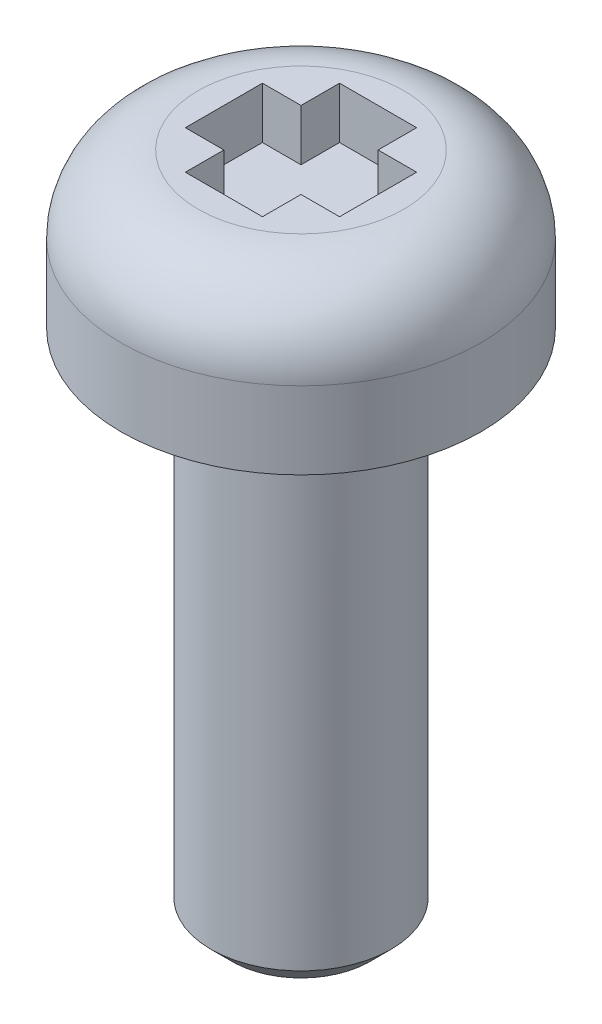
ISO-10303-21;
HEADER;
FILE_DESCRIPTION(('STEP AP214'),'2;1');
FILE_NAME('part.step','',(''),(''),'','','');
FILE_SCHEMA(('AUTOMOTIVE_DESIGN { 1 0 10303 214 1 1 1 1 }'));
ENDSEC;
DATA;
#1=APPLICATION_CONTEXT('core data for automotive mechanical design processes');
#2=APPLICATION_PROTOCOL_DEFINITION('international standard','automotive_design',2000,#1);
#3=PRODUCT_CONTEXT('',#1,'mechanical');
#4=PRODUCT('Part','Part','',(#3));
#5=PRODUCT_RELATED_PRODUCT_CATEGORY('part','',(#4));
#6=PRODUCT_DEFINITION_FORMATION('','',#4);
#7=PRODUCT_DEFINITION_CONTEXT('part definition',#1,'design');
#8=PRODUCT_DEFINITION('design','',#6,#7);
#9=PRODUCT_DEFINITION_SHAPE('','',#8);
#10=(LENGTH_UNIT() NAMED_UNIT(*) SI_UNIT(.MILLI.,.METRE.));
#11=(NAMED_UNIT(*) PLANE_ANGLE_UNIT() SI_UNIT($,.RADIAN.));
#12=(NAMED_UNIT(*) SI_UNIT($,.STERADIAN.) SOLID_ANGLE_UNIT());
#13=UNCERTAINTY_MEASURE_WITH_UNIT(LENGTH_MEASURE(1.E-05),#10,'distance_accuracy_value','');
#14=(GEOMETRIC_REPRESENTATION_CONTEXT(3) GLOBAL_UNCERTAINTY_ASSIGNED_CONTEXT((#13)) GLOBAL_UNIT_ASSIGNED_CONTEXT((#10,
#11,#12)) REPRESENTATION_CONTEXT('',''));
#15=CARTESIAN_POINT('',(0.,0.,0.));
#16=DIRECTION('',(0.,0.,1.));
#17=DIRECTION('',(1.,0.,0.));
#18=AXIS2_PLACEMENT_3D('',#15,#16,#17);
#19=CARTESIAN_POINT('',(3.5,0.,0.));
#20=DIRECTION('',(0.,1.,0.));
#21=DIRECTION('',(0.,0.,1.));
#22=AXIS2_PLACEMENT_3D('',#19,#20,#21);
#23=PLANE('',#22);
#24=CARTESIAN_POINT('',(0.,0.,0.));
#25=DIRECTION('',(0.,1.,0.));
#26=DIRECTION('',(0.,0.,1.));
#27=AXIS2_PLACEMENT_3D('',#24,#25,#26);
#28=CIRCLE('',#27,2.2072);
#29=CARTESIAN_POINT('',(0.,0.,2.2072));
#30=VERTEX_POINT('',#29);
#31=EDGE_CURVE('E208',#30,#30,#28,.T.);
#32=ORIENTED_EDGE('',*,*,#31,.T.);
#33=EDGE_LOOP('',(#32));
#34=FACE_BOUND('',#33,.T.);
#35=CARTESIAN_POINT('',(0.,0.,0.));
#36=DIRECTION('',(0.,1.,0.));
#37=DIRECTION('',(0.,0.,1.));
#38=AXIS2_PLACEMENT_3D('',#35,#36,#37);
#39=CIRCLE('',#38,3.5);
#40=CARTESIAN_POINT('',(0.,0.,3.5));
#41=VERTEX_POINT('',#40);
#42=EDGE_CURVE('E202',#41,#41,#39,.T.);
#43=ORIENTED_EDGE('',*,*,#42,.F.);
#44=EDGE_LOOP('',(#43));
#45=FACE_BOUND('',#44,.T.);
#46=ADVANCED_FACE('F30',(#34,#45),#23,.F.);
#47=CARTESIAN_POINT('',(0.750000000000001,2.,1.5));
#48=DIRECTION('',(1.,0.,0.));
#49=DIRECTION('',(0.,0.,-1.));
#50=AXIS2_PLACEMENT_3D('',#47,#48,#49);
#51=PLANE('',#50);
#52=DIRECTION('',(0.,1.,0.));
#53=VECTOR('',#52,1.);
#54=CARTESIAN_POINT('',(0.75,2.,0.749999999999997));
#55=LINE('',#54,#53);
#56=CARTESIAN_POINT('',(0.750000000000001,2.,0.749999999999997));
#57=VERTEX_POINT('',#56);
#58=CARTESIAN_POINT('',(0.75,3.,0.749999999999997));
#59=VERTEX_POINT('',#58);
#60=EDGE_CURVE('E152',#57,#59,#55,.T.);
#61=ORIENTED_EDGE('',*,*,#60,.F.);
#62=DIRECTION('',(0.,0.,-1.));
#63=VECTOR('',#62,1.);
#64=CARTESIAN_POINT('',(0.750000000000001,2.,1.5));
#65=LINE('',#64,#63);
#66=CARTESIAN_POINT('',(0.750000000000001,2.,1.5));
#67=VERTEX_POINT('',#66);
#68=EDGE_CURVE('E161',#67,#57,#65,.T.);
#69=ORIENTED_EDGE('',*,*,#68,.F.);
#70=DIRECTION('',(0.,1.,0.));
#71=VECTOR('',#70,1.);
#72=CARTESIAN_POINT('',(0.750000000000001,2.,1.5));
#73=LINE('',#72,#71);
#74=CARTESIAN_POINT('',(0.750000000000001,3.,1.5));
#75=VERTEX_POINT('',#74);
#76=EDGE_CURVE('E187',#67,#75,#73,.T.);
#77=ORIENTED_EDGE('',*,*,#76,.T.);
#78=DIRECTION('',(0.,0.,-1.));
#79=VECTOR('',#78,1.);
#80=CARTESIAN_POINT('',(0.750000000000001,3.,1.5));
#81=LINE('',#80,#79);
#82=EDGE_CURVE('E174',#75,#59,#81,.T.);
#83=ORIENTED_EDGE('',*,*,#82,.T.);
#84=EDGE_LOOP('',(#61,#69,#77,#83));
#85=FACE_BOUND('',#84,.T.);
#86=ADVANCED_FACE('F224',(#85),#51,.F.);
#87=CARTESIAN_POINT('',(-0.749999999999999,2.,1.5));
#88=DIRECTION('',(1.,0.,0.));
#89=DIRECTION('',(0.,0.,-1.));
#90=AXIS2_PLACEMENT_3D('',#87,#88,#89);
#91=PLANE('',#90);
#92=DIRECTION('',(0.,0.,-1.));
#93=VECTOR('',#92,1.);
#94=CARTESIAN_POINT('',(-0.749999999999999,2.,1.5));
#95=LINE('',#94,#93);
#96=CARTESIAN_POINT('',(-0.749999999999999,2.,1.5));
#97=VERTEX_POINT('',#96);
#98=CARTESIAN_POINT('',(-0.75,2.,0.75));
#99=VERTEX_POINT('',#98);
#100=EDGE_CURVE('E168',#97,#99,#95,.T.);
#101=ORIENTED_EDGE('',*,*,#100,.T.);
#102=DIRECTION('',(0.,1.,0.));
#103=VECTOR('',#102,1.);
#104=CARTESIAN_POINT('',(-0.75,2.,0.750000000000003));
#105=LINE('',#104,#103);
#106=CARTESIAN_POINT('',(-0.75,3.,0.750000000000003));
#107=VERTEX_POINT('',#106);
#108=EDGE_CURVE('E149',#99,#107,#105,.T.);
#109=ORIENTED_EDGE('',*,*,#108,.T.);
#110=DIRECTION('',(0.,0.,-1.));
#111=VECTOR('',#110,1.);
#112=CARTESIAN_POINT('',(-0.749999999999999,3.,1.5));
#113=LINE('',#112,#111);
#114=CARTESIAN_POINT('',(-0.749999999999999,3.,1.5));
#115=VERTEX_POINT('',#114);
#116=EDGE_CURVE('E181',#115,#107,#113,.T.);
#117=ORIENTED_EDGE('',*,*,#116,.F.);
#118=DIRECTION('',(0.,1.,0.));
#119=VECTOR('',#118,1.);
#120=CARTESIAN_POINT('',(-0.749999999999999,2.,1.5));
#121=LINE('',#120,#119);
#122=EDGE_CURVE('E190',#97,#115,#121,.T.);
#123=ORIENTED_EDGE('',*,*,#122,.F.);
#124=EDGE_LOOP('',(#101,#109,#117,#123));
#125=FACE_BOUND('',#124,.T.);
#126=ADVANCED_FACE('F230',(#125),#91,.T.);
#127=CARTESIAN_POINT('',(0.,11.592517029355,0.));
#128=DIRECTION('',(0.,1.,0.));
#129=DIRECTION('',(0.,0.,1.));
#130=AXIS2_PLACEMENT_3D('',#127,#128,#129);
#131=CYLINDRICAL_SURFACE('',#130,3.5);
#132=CARTESIAN_POINT('',(0.,1.5,0.));
#133=DIRECTION('',(0.,1.,0.));
#134=DIRECTION('',(0.,0.,1.));
#135=AXIS2_PLACEMENT_3D('',#132,#133,#134);
#136=CIRCLE('',#135,3.5);
#137=CARTESIAN_POINT('',(0.,1.5,3.5));
#138=VERTEX_POINT('',#137);
#139=EDGE_CURVE('E199',#138,#138,#136,.T.);
#140=ORIENTED_EDGE('',*,*,#139,.F.);
#141=EDGE_LOOP('',(#140));
#142=FACE_BOUND('',#141,.T.);
#143=ORIENTED_EDGE('',*,*,#42,.T.);
#144=EDGE_LOOP('',(#143));
#145=FACE_BOUND('',#144,.T.);
#146=ADVANCED_FACE('F236',(#142,#145),#131,.T.);
#147=CARTESIAN_POINT('',(0.,1.5,0.));
#148=DIRECTION('',(0.,1.,0.));
#149=DIRECTION('',(0.,0.,1.));
#150=AXIS2_PLACEMENT_3D('',#147,#148,#149);
#151=TOROIDAL_SURFACE('',#150,2.,1.5);
#152=CARTESIAN_POINT('',(0.,3.,0.));
#153=DIRECTION('',(0.,1.,0.));
#154=DIRECTION('',(0.,0.,1.));
#155=AXIS2_PLACEMENT_3D('',#152,#153,#154);
#156=CIRCLE('',#155,2.);
#157=CARTESIAN_POINT('',(0.,3.,2.));
#158=VERTEX_POINT('',#157);
#159=EDGE_CURVE('E189',#158,#158,#156,.T.);
#160=ORIENTED_EDGE('',*,*,#159,.F.);
#161=EDGE_LOOP('',(#160));
#162=FACE_BOUND('',#161,.T.);
#163=ORIENTED_EDGE('',*,*,#139,.T.);
#164=EDGE_LOOP('',(#163));
#165=FACE_BOUND('',#164,.T.);
#166=ADVANCED_FACE('F239',(#162,#165),#151,.T.);
#167=CARTESIAN_POINT('',(0.,3.,0.));
#168=DIRECTION('',(0.,-1.,0.));
#169=DIRECTION('',(0.,0.,-1.));
#170=AXIS2_PLACEMENT_3D('',#167,#168,#169);
#171=PLANE('',#170);
#172=CARTESIAN_POINT('',(0.75,3.,-0.750000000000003));
#173=VERTEX_POINT('',#172);
#174=CARTESIAN_POINT('',(0.75,3.,-1.5));
#175=VERTEX_POINT('',#174);
#176=EDGE_CURVE('E160',#173,#175,#81,.T.);
#177=ORIENTED_EDGE('',*,*,#176,.F.);
#178=DIRECTION('',(-1.,0.,0.));
#179=VECTOR('',#178,1.);
#180=CARTESIAN_POINT('',(1.5,3.,-0.750000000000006));
#181=LINE('',#180,#179);
#182=CARTESIAN_POINT('',(1.5,3.,-0.750000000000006));
#183=VERTEX_POINT('',#182);
#184=EDGE_CURVE('E437',#183,#173,#181,.T.);
#185=ORIENTED_EDGE('',*,*,#184,.F.);
#186=DIRECTION('',(0.,0.,1.));
#187=VECTOR('',#186,1.);
#188=CARTESIAN_POINT('',(1.5,3.,-0.750000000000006));
#189=LINE('',#188,#187);
#190=CARTESIAN_POINT('',(1.5,3.,0.749999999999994));
#191=VERTEX_POINT('',#190);
#192=EDGE_CURVE('E127',#183,#191,#189,.T.);
#193=ORIENTED_EDGE('',*,*,#192,.T.);
#194=DIRECTION('',(-1.,0.,0.));
#195=VECTOR('',#194,1.);
#196=CARTESIAN_POINT('',(1.5,3.,0.749999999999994));
#197=LINE('',#196,#195);
#198=EDGE_CURVE('E422',#191,#59,#197,.T.);
#199=ORIENTED_EDGE('',*,*,#198,.T.);
#200=ORIENTED_EDGE('',*,*,#82,.F.);
#201=DIRECTION('',(-1.,0.,0.));
#202=VECTOR('',#201,1.);
#203=CARTESIAN_POINT('',(0.750000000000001,3.,1.5));
#204=LINE('',#203,#202);
#205=EDGE_CURVE('E184',#75,#115,#204,.T.);
#206=ORIENTED_EDGE('',*,*,#205,.T.);
#207=ORIENTED_EDGE('',*,*,#116,.T.);
#208=CARTESIAN_POINT('',(-1.5,3.,0.750000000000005));
#209=VERTEX_POINT('',#208);
#210=EDGE_CURVE('E428',#107,#209,#197,.T.);
#211=ORIENTED_EDGE('',*,*,#210,.T.);
#212=DIRECTION('',(0.,0.,-1.));
#213=VECTOR('',#212,1.);
#214=CARTESIAN_POINT('',(-1.5,3.,0.750000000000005));
#215=LINE('',#214,#213);
#216=CARTESIAN_POINT('',(-1.5,3.,-0.749999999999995));
#217=VERTEX_POINT('',#216);
#218=EDGE_CURVE('E432',#209,#217,#215,.T.);
#219=ORIENTED_EDGE('',*,*,#218,.T.);
#220=CARTESIAN_POINT('',(-0.75,3.,-0.749999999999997));
#221=VERTEX_POINT('',#220);
#222=EDGE_CURVE('E140',#221,#217,#181,.T.);
#223=ORIENTED_EDGE('',*,*,#222,.F.);
#224=CARTESIAN_POINT('',(-0.75,3.,-1.5));
#225=VERTEX_POINT('',#224);
#226=EDGE_CURVE('E180',#221,#225,#113,.T.);
#227=ORIENTED_EDGE('',*,*,#226,.T.);
#228=DIRECTION('',(1.,0.,0.));
#229=VECTOR('',#228,1.);
#230=CARTESIAN_POINT('',(-0.75,3.,-1.5));
#231=LINE('',#230,#229);
#232=EDGE_CURVE('E177',#225,#175,#231,.T.);
#233=ORIENTED_EDGE('',*,*,#232,.T.);
#234=EDGE_LOOP('',(#177,#185,#193,#199,#200,#206,#207,#211,#219,#223,#227,#233));
#235=FACE_BOUND('',#234,.T.);
#236=ORIENTED_EDGE('',*,*,#159,.T.);
#237=EDGE_LOOP('',(#236));
#238=FACE_BOUND('',#237,.T.);
#239=ADVANCED_FACE('F243',(#235,#238),#171,.F.);
#240=CARTESIAN_POINT('',(0.75,2.,-0.75));
#241=VERTEX_POINT('',#240);
#242=CARTESIAN_POINT('',(0.75,2.,-1.5));
#243=VERTEX_POINT('',#242);
#244=EDGE_CURVE('E165',#241,#243,#65,.T.);
#245=ORIENTED_EDGE('',*,*,#244,.F.);
#246=DIRECTION('',(0.,1.,0.));
#247=VECTOR('',#246,1.);
#248=CARTESIAN_POINT('',(0.75,2.,-0.750000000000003));
#249=LINE('',#248,#247);
#250=EDGE_CURVE('E157',#241,#173,#249,.T.);
#251=ORIENTED_EDGE('',*,*,#250,.T.);
#252=ORIENTED_EDGE('',*,*,#176,.T.);
#253=DIRECTION('',(0.,1.,0.));
#254=VECTOR('',#253,1.);
#255=CARTESIAN_POINT('',(0.75,2.,-1.5));
#256=LINE('',#255,#254);
#257=EDGE_CURVE('E173',#243,#175,#256,.T.);
#258=ORIENTED_EDGE('',*,*,#257,.F.);
#259=EDGE_LOOP('',(#245,#251,#252,#258));
#260=FACE_BOUND('',#259,.T.);
#261=ADVANCED_FACE('F233',(#260),#51,.F.);
#262=CARTESIAN_POINT('',(0.750000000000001,2.,1.5));
#263=DIRECTION('',(0.,0.,-1.));
#264=DIRECTION('',(-1.,0.,0.));
#265=AXIS2_PLACEMENT_3D('',#262,#263,#264);
#266=PLANE('',#265);
#267=ORIENTED_EDGE('',*,*,#205,.F.);
#268=ORIENTED_EDGE('',*,*,#76,.F.);
#269=DIRECTION('',(-1.,0.,0.));
#270=VECTOR('',#269,1.);
#271=CARTESIAN_POINT('',(0.750000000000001,2.,1.5));
#272=LINE('',#271,#270);
#273=EDGE_CURVE('E171',#67,#97,#272,.T.);
#274=ORIENTED_EDGE('',*,*,#273,.T.);
#275=ORIENTED_EDGE('',*,*,#122,.T.);
#276=EDGE_LOOP('',(#267,#268,#274,#275));
#277=FACE_BOUND('',#276,.T.);
#278=ADVANCED_FACE('F249',(#277),#266,.T.);
#279=DIRECTION('',(0.,1.,0.));
#280=VECTOR('',#279,1.);
#281=CARTESIAN_POINT('',(-0.75,2.,-0.749999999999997));
#282=LINE('',#281,#280);
#283=CARTESIAN_POINT('',(-0.75,2.,-0.749999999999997));
#284=VERTEX_POINT('',#283);
#285=EDGE_CURVE('E155',#284,#221,#282,.T.);
#286=ORIENTED_EDGE('',*,*,#285,.F.);
#287=CARTESIAN_POINT('',(-0.75,2.,-1.5));
#288=VERTEX_POINT('',#287);
#289=EDGE_CURVE('E123',#284,#288,#95,.T.);
#290=ORIENTED_EDGE('',*,*,#289,.T.);
#291=DIRECTION('',(0.,1.,0.));
#292=VECTOR('',#291,1.);
#293=CARTESIAN_POINT('',(-0.75,2.,-1.5));
#294=LINE('',#293,#292);
#295=EDGE_CURVE('E192',#288,#225,#294,.T.);
#296=ORIENTED_EDGE('',*,*,#295,.T.);
#297=ORIENTED_EDGE('',*,*,#226,.F.);
#298=EDGE_LOOP('',(#286,#290,#296,#297));
#299=FACE_BOUND('',#298,.T.);
#300=ADVANCED_FACE('F254',(#299),#91,.T.);
#301=CARTESIAN_POINT('',(-0.75,2.,-1.5));
#302=DIRECTION('',(0.,0.,1.));
#303=DIRECTION('',(1.,0.,0.));
#304=AXIS2_PLACEMENT_3D('',#301,#302,#303);
#305=PLANE('',#304);
#306=ORIENTED_EDGE('',*,*,#232,.F.);
#307=ORIENTED_EDGE('',*,*,#295,.F.);
#308=DIRECTION('',(1.,0.,0.));
#309=VECTOR('',#308,1.);
#310=CARTESIAN_POINT('',(-0.75,2.,-1.5));
#311=LINE('',#310,#309);
#312=EDGE_CURVE('E164',#288,#243,#311,.T.);
#313=ORIENTED_EDGE('',*,*,#312,.T.);
#314=ORIENTED_EDGE('',*,*,#257,.T.);
#315=EDGE_LOOP('',(#306,#307,#313,#314));
#316=FACE_BOUND('',#315,.T.);
#317=ADVANCED_FACE('F251',(#316),#305,.T.);
#318=CARTESIAN_POINT('',(0.75,2.,-1.5));
#319=DIRECTION('',(0.,-1.,0.));
#320=DIRECTION('',(0.,0.,-1.));
#321=AXIS2_PLACEMENT_3D('',#318,#319,#320);
#322=PLANE('',#321);
#323=ORIENTED_EDGE('',*,*,#289,.F.);
#324=DIRECTION('',(-1.,0.,0.));
#325=VECTOR('',#324,1.);
#326=CARTESIAN_POINT('',(1.5,2.,-0.750000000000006));
#327=LINE('',#326,#325);
#328=CARTESIAN_POINT('',(-1.5,2.,-0.749999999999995));
#329=VERTEX_POINT('',#328);
#330=EDGE_CURVE('E118',#284,#329,#327,.T.);
#331=ORIENTED_EDGE('',*,*,#330,.T.);
#332=DIRECTION('',(0.,0.,-1.));
#333=VECTOR('',#332,1.);
#334=CARTESIAN_POINT('',(-1.5,2.,0.750000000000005));
#335=LINE('',#334,#333);
#336=CARTESIAN_POINT('',(-1.5,2.,0.750000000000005));
#337=VERTEX_POINT('',#336);
#338=EDGE_CURVE('E121',#337,#329,#335,.T.);
#339=ORIENTED_EDGE('',*,*,#338,.F.);
#340=DIRECTION('',(-1.,0.,0.));
#341=VECTOR('',#340,1.);
#342=CARTESIAN_POINT('',(1.5,2.,0.749999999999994));
#343=LINE('',#342,#341);
#344=EDGE_CURVE('E45',#99,#337,#343,.T.);
#345=ORIENTED_EDGE('',*,*,#344,.F.);
#346=ORIENTED_EDGE('',*,*,#100,.F.);
#347=ORIENTED_EDGE('',*,*,#273,.F.);
#348=ORIENTED_EDGE('',*,*,#68,.T.);
#349=CARTESIAN_POINT('',(1.5,2.,0.749999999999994));
#350=VERTEX_POINT('',#349);
#351=EDGE_CURVE('E145',#350,#57,#343,.T.);
#352=ORIENTED_EDGE('',*,*,#351,.F.);
#353=DIRECTION('',(0.,0.,1.));
#354=VECTOR('',#353,1.);
#355=CARTESIAN_POINT('',(1.5,2.,-0.750000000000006));
#356=LINE('',#355,#354);
#357=CARTESIAN_POINT('',(1.5,2.,-0.750000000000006));
#358=VERTEX_POINT('',#357);
#359=EDGE_CURVE('E141',#358,#350,#356,.T.);
#360=ORIENTED_EDGE('',*,*,#359,.F.);
#361=EDGE_CURVE('E52',#358,#241,#327,.T.);
#362=ORIENTED_EDGE('',*,*,#361,.T.);
#363=ORIENTED_EDGE('',*,*,#244,.T.);
#364=ORIENTED_EDGE('',*,*,#312,.F.);
#365=EDGE_LOOP('',(#323,#331,#339,#345,#346,#347,#348,#352,#360,#362,#363,#364));
#366=FACE_BOUND('',#365,.T.);
#367=ADVANCED_FACE('F120',(#366),#322,.F.);
#368=CARTESIAN_POINT('',(1.5,2.,0.749999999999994));
#369=DIRECTION('',(0.,0.,-1.));
#370=DIRECTION('',(-1.,0.,0.));
#371=AXIS2_PLACEMENT_3D('',#368,#369,#370);
#372=PLANE('',#371);
#373=ORIENTED_EDGE('',*,*,#344,.T.);
#374=DIRECTION('',(0.,1.,0.));
#375=VECTOR('',#374,1.);
#376=CARTESIAN_POINT('',(-1.5,2.,0.750000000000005));
#377=LINE('',#376,#375);
#378=EDGE_CURVE('E136',#337,#209,#377,.T.);
#379=ORIENTED_EDGE('',*,*,#378,.T.);
#380=ORIENTED_EDGE('',*,*,#210,.F.);
#381=ORIENTED_EDGE('',*,*,#108,.F.);
#382=EDGE_LOOP('',(#373,#379,#380,#381));
#383=FACE_BOUND('',#382,.T.);
#384=ADVANCED_FACE('F264',(#383),#372,.T.);
#385=CARTESIAN_POINT('',(1.5,2.,-0.750000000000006));
#386=DIRECTION('',(0.,0.,-1.));
#387=DIRECTION('',(-1.,0.,0.));
#388=AXIS2_PLACEMENT_3D('',#385,#386,#387);
#389=PLANE('',#388);
#390=ORIENTED_EDGE('',*,*,#285,.T.);
#391=ORIENTED_EDGE('',*,*,#222,.T.);
#392=DIRECTION('',(0.,1.,0.));
#393=VECTOR('',#392,1.);
#394=CARTESIAN_POINT('',(-1.5,2.,-0.749999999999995));
#395=LINE('',#394,#393);
#396=EDGE_CURVE('E134',#329,#217,#395,.T.);
#397=ORIENTED_EDGE('',*,*,#396,.F.);
#398=ORIENTED_EDGE('',*,*,#330,.F.);
#399=EDGE_LOOP('',(#390,#391,#397,#398));
#400=FACE_BOUND('',#399,.T.);
#401=ADVANCED_FACE('F138',(#400),#389,.F.);
#402=CARTESIAN_POINT('',(-1.5,2.,0.750000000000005));
#403=DIRECTION('',(1.,0.,0.));
#404=DIRECTION('',(0.,0.,-1.));
#405=AXIS2_PLACEMENT_3D('',#402,#403,#404);
#406=PLANE('',#405);
#407=ORIENTED_EDGE('',*,*,#218,.F.);
#408=ORIENTED_EDGE('',*,*,#378,.F.);
#409=ORIENTED_EDGE('',*,*,#338,.T.);
#410=ORIENTED_EDGE('',*,*,#396,.T.);
#411=EDGE_LOOP('',(#407,#408,#409,#410));
#412=FACE_BOUND('',#411,.T.);
#413=ADVANCED_FACE('F133',(#412),#406,.T.);
#414=ORIENTED_EDGE('',*,*,#361,.F.);
#415=DIRECTION('',(0.,1.,0.));
#416=VECTOR('',#415,1.);
#417=CARTESIAN_POINT('',(1.5,2.,-0.750000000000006));
#418=LINE('',#417,#416);
#419=EDGE_CURVE('E153',#358,#183,#418,.T.);
#420=ORIENTED_EDGE('',*,*,#419,.T.);
#421=ORIENTED_EDGE('',*,*,#184,.T.);
#422=ORIENTED_EDGE('',*,*,#250,.F.);
#423=EDGE_LOOP('',(#414,#420,#421,#422));
#424=FACE_BOUND('',#423,.T.);
#425=ADVANCED_FACE('F267',(#424),#389,.F.);
#426=ORIENTED_EDGE('',*,*,#60,.T.);
#427=ORIENTED_EDGE('',*,*,#198,.F.);
#428=DIRECTION('',(0.,1.,0.));
#429=VECTOR('',#428,1.);
#430=CARTESIAN_POINT('',(1.5,2.,0.749999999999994));
#431=LINE('',#430,#429);
#432=EDGE_CURVE('E143',#350,#191,#431,.T.);
#433=ORIENTED_EDGE('',*,*,#432,.F.);
#434=ORIENTED_EDGE('',*,*,#351,.T.);
#435=EDGE_LOOP('',(#426,#427,#433,#434));
#436=FACE_BOUND('',#435,.T.);
#437=ADVANCED_FACE('F273',(#436),#372,.T.);
#438=CARTESIAN_POINT('',(1.5,2.,-0.750000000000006));
#439=DIRECTION('',(-1.,0.,0.));
#440=DIRECTION('',(0.,0.,1.));
#441=AXIS2_PLACEMENT_3D('',#438,#439,#440);
#442=PLANE('',#441);
#443=ORIENTED_EDGE('',*,*,#192,.F.);
#444=ORIENTED_EDGE('',*,*,#419,.F.);
#445=ORIENTED_EDGE('',*,*,#359,.T.);
#446=ORIENTED_EDGE('',*,*,#432,.T.);
#447=EDGE_LOOP('',(#443,#444,#445,#446));
#448=FACE_BOUND('',#447,.T.);
#449=ADVANCED_FACE('F274',(#448),#442,.T.);
#450=CARTESIAN_POINT('',(0.,-10.,0.));
#451=DIRECTION('',(0.,1.,0.));
#452=DIRECTION('',(0.,0.,1.));
#453=AXIS2_PLACEMENT_3D('',#450,#451,#452);
#454=CYLINDRICAL_SURFACE('',#453,1.75);
#455=CARTESIAN_POINT('',(0.,-9.5936,0.));
#456=DIRECTION('',(0.,-1.,0.));
#457=DIRECTION('',(0.,0.,-1.));
#458=AXIS2_PLACEMENT_3D('',#455,#456,#457);
#459=CIRCLE('',#458,1.75);
#460=CARTESIAN_POINT('',(0.,-9.5936,-1.75));
#461=VERTEX_POINT('',#460);
#462=EDGE_CURVE('E11',#461,#461,#459,.F.);
#463=ORIENTED_EDGE('',*,*,#462,.T.);
#464=EDGE_LOOP('',(#463));
#465=FACE_BOUND('',#464,.T.);
#466=CARTESIAN_POINT('',(0.,-0.4572,0.));
#467=DIRECTION('',(0.,1.,0.));
#468=DIRECTION('',(0.,0.,1.));
#469=AXIS2_PLACEMENT_3D('',#466,#467,#468);
#470=CIRCLE('',#469,1.75);
#471=CARTESIAN_POINT('',(0.,-0.4572,1.75));
#472=VERTEX_POINT('',#471);
#473=EDGE_CURVE('E205',#472,#472,#470,.F.);
#474=ORIENTED_EDGE('',*,*,#473,.T.);
#475=EDGE_LOOP('',(#474));
#476=FACE_BOUND('',#475,.T.);
#477=ADVANCED_FACE('F277',(#465,#476),#454,.T.);
#478=CARTESIAN_POINT('',(0.,-10.,0.));
#479=DIRECTION('',(0.,-1.,0.));
#480=DIRECTION('',(0.,0.,-1.));
#481=AXIS2_PLACEMENT_3D('',#478,#479,#480);
#482=PLANE('',#481);
#483=CARTESIAN_POINT('',(0.,-10.,0.));
#484=DIRECTION('',(0.,-1.,0.));
#485=DIRECTION('',(0.,0.,-1.));
#486=AXIS2_PLACEMENT_3D('',#483,#484,#485);
#487=CIRCLE('',#486,1.3436);
#488=CARTESIAN_POINT('',(0.,-10.,-1.3436));
#489=VERTEX_POINT('',#488);
#490=EDGE_CURVE('E38',#489,#489,#487,.T.);
#491=ORIENTED_EDGE('',*,*,#490,.T.);
#492=EDGE_LOOP('',(#491));
#493=FACE_BOUND('',#492,.T.);
#494=ADVANCED_FACE('F213',(#493),#482,.T.);
#495=CARTESIAN_POINT('',(0.,-0.4572,0.));
#496=DIRECTION('',(0.,1.,0.));
#497=DIRECTION('',(0.,0.,1.));
#498=AXIS2_PLACEMENT_3D('',#495,#496,#497);
#499=TOROIDAL_SURFACE('',#498,2.2072,0.4572);
#500=ORIENTED_EDGE('',*,*,#31,.F.);
#501=EDGE_LOOP('',(#500));
#502=FACE_BOUND('',#501,.T.);
#503=ORIENTED_EDGE('',*,*,#473,.F.);
#504=EDGE_LOOP('',(#503));
#505=FACE_BOUND('',#504,.T.);
#506=ADVANCED_FACE('F216',(#502,#505),#499,.F.);
#507=CARTESIAN_POINT('',(0.,-10.,0.));
#508=DIRECTION('',(0.,1.,0.));
#509=DIRECTION('',(0.,0.,1.));
#510=AXIS2_PLACEMENT_3D('',#507,#508,#509);
#511=CONICAL_SURFACE('',#510,1.3436,0.785398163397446);
#512=ORIENTED_EDGE('',*,*,#462,.F.);
#513=EDGE_LOOP('',(#512));
#514=FACE_BOUND('',#513,.T.);
#515=ORIENTED_EDGE('',*,*,#490,.F.);
#516=EDGE_LOOP('',(#515));
#517=FACE_BOUND('',#516,.T.);
#518=ADVANCED_FACE('F32',(#514,#517),#511,.T.);
#519=CLOSED_SHELL('',(#46,#86,#126,#146,#166,#239,#261,#278,#300,#317,#367,#384,#401,#413,#425,
#437,#449,#477,#494,#506,#518));
#520=MANIFOLD_SOLID_BREP('B2',#519);
#521=ADVANCED_BREP_SHAPE_REPRESENTATION('',(#18,#520),#14);
#522=SHAPE_DEFINITION_REPRESENTATION(#9,#521);
ENDSEC;
END-ISO-10303-21;
